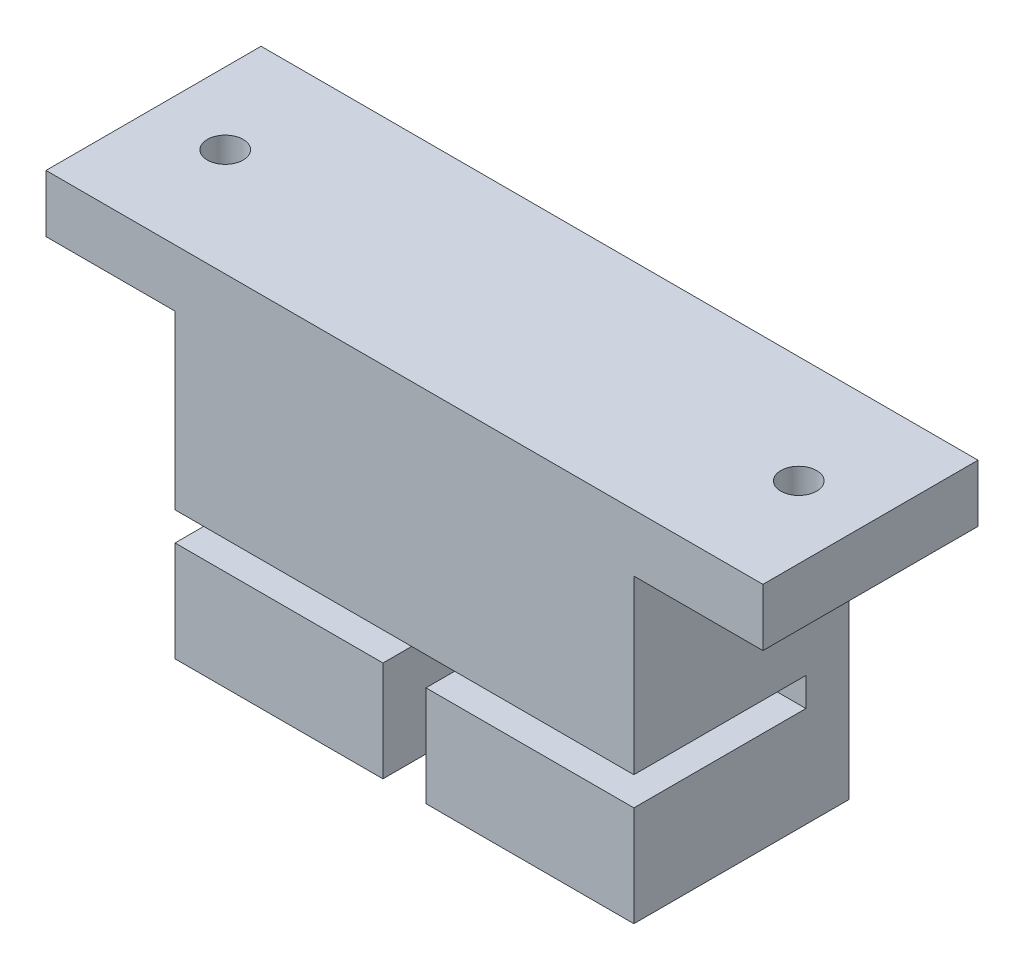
from build123d import *

# Parameters (mm, degrees)
SALIENTE_EXTRUIR1_DEPTH = 15
CORTAR_EXTRUIR1_DEPTH   = 12
CROQUIS3_R              = 1.25
CORTAR_EXTRUIR2_DEPTH   = 12


with BuildPart() as part:
    # Croquis1 → Saliente-Extruir1 (new body)
    with BuildSketch(Plane.XY):
        Polygon((16, 10.5), (25, 10.5), (25, 14.5), (-25, 14.5), (-25, 10.5), (-16, 10.5), (-16, -10.5), (16, -10.5), align=None)
    extrude(amount=SALIENTE_EXTRUIR1_DEPTH)

    # Croquis2 → Cortar-Extruir1 (cut)
    with BuildSketch(Plane.XY.offset(15)):
        Polygon((-1.5, -10.5), (1.5, -10.5), (1.5, -3.5), (16, -3.5), (16, -1.5), (-16, -1.5), (-16, -3.5), (-1.5, -3.5), align=None)
    extrude(amount=-CORTAR_EXTRUIR1_DEPTH, mode=Mode.SUBTRACT)

    # Croquis3 → Cortar-Extruir2 (cut)
    with BuildSketch(Plane(origin=(0, 14.5, 0), x_dir=(1, 0, 0), z_dir=(0, 1, 0))):
        with Locations(Location((-20, -7.5, 0), (0, 0, 270))):
            Circle(CROQUIS3_R)
        with Locations(Location((20, -7.5, 0), (0, 0, 270))):
            Circle(CROQUIS3_R)
    extrude(amount=-CORTAR_EXTRUIR2_DEPTH, mode=Mode.SUBTRACT)


solid = part.part
